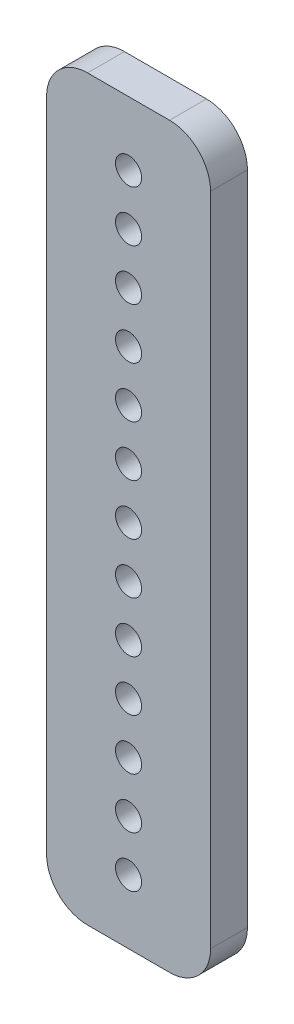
ISO-10303-21;
HEADER;
FILE_DESCRIPTION(('STEP AP214'),'2;1');
FILE_NAME('part.step','',(''),(''),'','','');
FILE_SCHEMA(('AUTOMOTIVE_DESIGN { 1 0 10303 214 1 1 1 1 }'));
ENDSEC;
DATA;
#1=APPLICATION_CONTEXT('core data for automotive mechanical design processes');
#2=APPLICATION_PROTOCOL_DEFINITION('international standard','automotive_design',2000,#1);
#3=PRODUCT_CONTEXT('',#1,'mechanical');
#4=PRODUCT('Part','Part','',(#3));
#5=PRODUCT_RELATED_PRODUCT_CATEGORY('part','',(#4));
#6=PRODUCT_DEFINITION_FORMATION('','',#4);
#7=PRODUCT_DEFINITION_CONTEXT('part definition',#1,'design');
#8=PRODUCT_DEFINITION('design','',#6,#7);
#9=PRODUCT_DEFINITION_SHAPE('','',#8);
#10=(LENGTH_UNIT() NAMED_UNIT(*) SI_UNIT(.MILLI.,.METRE.));
#11=(NAMED_UNIT(*) PLANE_ANGLE_UNIT() SI_UNIT($,.RADIAN.));
#12=(NAMED_UNIT(*) SI_UNIT($,.STERADIAN.) SOLID_ANGLE_UNIT());
#13=UNCERTAINTY_MEASURE_WITH_UNIT(LENGTH_MEASURE(1.E-05),#10,'distance_accuracy_value','');
#14=(GEOMETRIC_REPRESENTATION_CONTEXT(3) GLOBAL_UNCERTAINTY_ASSIGNED_CONTEXT((#13)) GLOBAL_UNIT_ASSIGNED_CONTEXT((#10,
#11,#12)) REPRESENTATION_CONTEXT('',''));
#15=CARTESIAN_POINT('',(0.,0.,0.));
#16=DIRECTION('',(0.,0.,1.));
#17=DIRECTION('',(1.,0.,0.));
#18=AXIS2_PLACEMENT_3D('',#15,#16,#17);
#19=CARTESIAN_POINT('',(12.7,57.15,5.715));
#20=DIRECTION('',(-1.,0.,0.));
#21=DIRECTION('',(0.,-1.,0.));
#22=AXIS2_PLACEMENT_3D('',#19,#20,#21);
#23=PLANE('',#22);
#24=DIRECTION('',(0.,1.,0.));
#25=VECTOR('',#24,1.);
#26=CARTESIAN_POINT('',(12.7,57.15,5.715));
#27=LINE('',#26,#25);
#28=CARTESIAN_POINT('',(12.7,-50.8,5.715));
#29=VERTEX_POINT('',#28);
#30=CARTESIAN_POINT('',(12.7,50.8,5.715));
#31=VERTEX_POINT('',#30);
#32=EDGE_CURVE('E119',#29,#31,#27,.T.);
#33=ORIENTED_EDGE('',*,*,#32,.F.);
#34=DIRECTION('',(0.,0.,-1.));
#35=VECTOR('',#34,1.);
#36=CARTESIAN_POINT('',(12.7,-50.8,5.715));
#37=LINE('',#36,#35);
#38=CARTESIAN_POINT('',(12.7,-50.8,0.));
#39=VERTEX_POINT('',#38);
#40=EDGE_CURVE('E104',#29,#39,#37,.T.);
#41=ORIENTED_EDGE('',*,*,#40,.T.);
#42=DIRECTION('',(0.,1.,0.));
#43=VECTOR('',#42,1.);
#44=CARTESIAN_POINT('',(12.7,57.15,0.));
#45=LINE('',#44,#43);
#46=CARTESIAN_POINT('',(12.7,50.8,0.));
#47=VERTEX_POINT('',#46);
#48=EDGE_CURVE('E116',#39,#47,#45,.T.);
#49=ORIENTED_EDGE('',*,*,#48,.T.);
#50=DIRECTION('',(0.,0.,-1.));
#51=VECTOR('',#50,1.);
#52=CARTESIAN_POINT('',(12.7,50.8,5.715));
#53=LINE('',#52,#51);
#54=EDGE_CURVE('E121',#47,#31,#53,.F.);
#55=ORIENTED_EDGE('',*,*,#54,.T.);
#56=EDGE_LOOP('',(#33,#41,#49,#55));
#57=FACE_BOUND('',#56,.T.);
#58=ADVANCED_FACE('F33',(#57),#23,.F.);
#59=CARTESIAN_POINT('',(-12.7,57.15,5.715));
#60=DIRECTION('',(0.,-1.,0.));
#61=DIRECTION('',(0.,0.,-1.));
#62=AXIS2_PLACEMENT_3D('',#59,#60,#61);
#63=PLANE('',#62);
#64=DIRECTION('',(-1.,0.,0.));
#65=VECTOR('',#64,1.);
#66=CARTESIAN_POINT('',(-12.7,57.15,5.715));
#67=LINE('',#66,#65);
#68=CARTESIAN_POINT('',(6.34999999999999,57.15,5.715));
#69=VERTEX_POINT('',#68);
#70=CARTESIAN_POINT('',(-6.35,57.15,5.715));
#71=VERTEX_POINT('',#70);
#72=EDGE_CURVE('E163',#69,#71,#67,.T.);
#73=ORIENTED_EDGE('',*,*,#72,.F.);
#74=DIRECTION('',(0.,0.,-1.));
#75=VECTOR('',#74,1.);
#76=CARTESIAN_POINT('',(6.34999999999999,57.15,5.715));
#77=LINE('',#76,#75);
#78=CARTESIAN_POINT('',(6.34999999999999,57.15,0.));
#79=VERTEX_POINT('',#78);
#80=EDGE_CURVE('E11',#69,#79,#77,.T.);
#81=ORIENTED_EDGE('',*,*,#80,.T.);
#82=DIRECTION('',(-1.,0.,0.));
#83=VECTOR('',#82,1.);
#84=CARTESIAN_POINT('',(-12.7,57.15,0.));
#85=LINE('',#84,#83);
#86=CARTESIAN_POINT('',(-6.35,57.15,0.));
#87=VERTEX_POINT('',#86);
#88=EDGE_CURVE('E126',#79,#87,#85,.T.);
#89=ORIENTED_EDGE('',*,*,#88,.T.);
#90=DIRECTION('',(0.,0.,-1.));
#91=VECTOR('',#90,1.);
#92=CARTESIAN_POINT('',(-6.35,57.15,5.715));
#93=LINE('',#92,#91);
#94=EDGE_CURVE('E41',#87,#71,#93,.F.);
#95=ORIENTED_EDGE('',*,*,#94,.T.);
#96=EDGE_LOOP('',(#73,#81,#89,#95));
#97=FACE_BOUND('',#96,.T.);
#98=ADVANCED_FACE('F162',(#97),#63,.F.);
#99=CARTESIAN_POINT('',(-12.7,57.15,5.715));
#100=DIRECTION('',(1.,0.,0.));
#101=DIRECTION('',(0.,1.,0.));
#102=AXIS2_PLACEMENT_3D('',#99,#100,#101);
#103=PLANE('',#102);
#104=DIRECTION('',(0.,-1.,0.));
#105=VECTOR('',#104,1.);
#106=CARTESIAN_POINT('',(-12.7,57.15,0.));
#107=LINE('',#106,#105);
#108=CARTESIAN_POINT('',(-12.7,50.8,0.));
#109=VERTEX_POINT('',#108);
#110=CARTESIAN_POINT('',(-12.7,-50.8,0.));
#111=VERTEX_POINT('',#110);
#112=EDGE_CURVE('E130',#109,#111,#107,.T.);
#113=ORIENTED_EDGE('',*,*,#112,.T.);
#114=DIRECTION('',(0.,0.,-1.));
#115=VECTOR('',#114,1.);
#116=CARTESIAN_POINT('',(-12.7,-50.8,5.715));
#117=LINE('',#116,#115);
#118=CARTESIAN_POINT('',(-12.7,-50.8,5.715));
#119=VERTEX_POINT('',#118);
#120=EDGE_CURVE('E48',#111,#119,#117,.F.);
#121=ORIENTED_EDGE('',*,*,#120,.T.);
#122=DIRECTION('',(0.,-1.,0.));
#123=VECTOR('',#122,1.);
#124=CARTESIAN_POINT('',(-12.7,57.15,5.715));
#125=LINE('',#124,#123);
#126=CARTESIAN_POINT('',(-12.7,50.8,5.715));
#127=VERTEX_POINT('',#126);
#128=EDGE_CURVE('E169',#127,#119,#125,.T.);
#129=ORIENTED_EDGE('',*,*,#128,.F.);
#130=DIRECTION('',(0.,0.,-1.));
#131=VECTOR('',#130,1.);
#132=CARTESIAN_POINT('',(-12.7,50.8,5.715));
#133=LINE('',#132,#131);
#134=EDGE_CURVE('E156',#127,#109,#133,.T.);
#135=ORIENTED_EDGE('',*,*,#134,.T.);
#136=EDGE_LOOP('',(#113,#121,#129,#135));
#137=FACE_BOUND('',#136,.T.);
#138=ADVANCED_FACE('F173',(#137),#103,.F.);
#139=CARTESIAN_POINT('',(-12.7,-57.15,5.715));
#140=DIRECTION('',(0.,1.,0.));
#141=DIRECTION('',(0.,0.,1.));
#142=AXIS2_PLACEMENT_3D('',#139,#140,#141);
#143=PLANE('',#142);
#144=DIRECTION('',(1.,0.,0.));
#145=VECTOR('',#144,1.);
#146=CARTESIAN_POINT('',(-12.7,-57.15,0.));
#147=LINE('',#146,#145);
#148=CARTESIAN_POINT('',(-6.34999999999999,-57.15,0.));
#149=VERTEX_POINT('',#148);
#150=CARTESIAN_POINT('',(6.35000000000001,-57.15,0.));
#151=VERTEX_POINT('',#150);
#152=EDGE_CURVE('E140',#149,#151,#147,.T.);
#153=ORIENTED_EDGE('',*,*,#152,.T.);
#154=DIRECTION('',(0.,0.,-1.));
#155=VECTOR('',#154,1.);
#156=CARTESIAN_POINT('',(6.35000000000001,-57.15,5.715));
#157=LINE('',#156,#155);
#158=CARTESIAN_POINT('',(6.35000000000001,-57.15,5.715));
#159=VERTEX_POINT('',#158);
#160=EDGE_CURVE('E105',#151,#159,#157,.F.);
#161=ORIENTED_EDGE('',*,*,#160,.T.);
#162=DIRECTION('',(1.,0.,0.));
#163=VECTOR('',#162,1.);
#164=CARTESIAN_POINT('',(-12.7,-57.15,5.715));
#165=LINE('',#164,#163);
#166=CARTESIAN_POINT('',(-6.34999999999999,-57.15,5.715));
#167=VERTEX_POINT('',#166);
#168=EDGE_CURVE('E136',#167,#159,#165,.T.);
#169=ORIENTED_EDGE('',*,*,#168,.F.);
#170=DIRECTION('',(0.,0.,-1.));
#171=VECTOR('',#170,1.);
#172=CARTESIAN_POINT('',(-6.34999999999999,-57.15,5.715));
#173=LINE('',#172,#171);
#174=EDGE_CURVE('E110',#167,#149,#173,.T.);
#175=ORIENTED_EDGE('',*,*,#174,.T.);
#176=EDGE_LOOP('',(#153,#161,#169,#175));
#177=FACE_BOUND('',#176,.T.);
#178=ADVANCED_FACE('F180',(#177),#143,.F.);
#179=CARTESIAN_POINT('',(0.,0.,5.715));
#180=DIRECTION('',(0.,0.,1.));
#181=DIRECTION('',(1.,0.,0.));
#182=AXIS2_PLACEMENT_3D('',#179,#180,#181);
#183=PLANE('',#182);
#184=CARTESIAN_POINT('',(1.16623225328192E-12,-47.244,5.715));
#185=DIRECTION('',(0.,0.,1.));
#186=DIRECTION('',(1.,0.,0.));
#187=AXIS2_PLACEMENT_3D('',#184,#185,#186);
#188=CIRCLE('',#187,2.0193);
#189=CARTESIAN_POINT('',(2.01930000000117,-47.244,5.715));
#190=VERTEX_POINT('',#189);
#191=EDGE_CURVE('E186',#190,#190,#188,.T.);
#192=ORIENTED_EDGE('',*,*,#191,.F.);
#193=EDGE_LOOP('',(#192));
#194=FACE_BOUND('',#193,.T.);
#195=CARTESIAN_POINT('',(9.71860211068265E-13,-39.37,5.715));
#196=DIRECTION('',(0.,0.,1.));
#197=DIRECTION('',(1.,0.,0.));
#198=AXIS2_PLACEMENT_3D('',#195,#196,#197);
#199=CIRCLE('',#198,2.0193);
#200=CARTESIAN_POINT('',(2.01930000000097,-39.37,5.715));
#201=VERTEX_POINT('',#200);
#202=EDGE_CURVE('E192',#201,#201,#199,.T.);
#203=ORIENTED_EDGE('',*,*,#202,.F.);
#204=EDGE_LOOP('',(#203));
#205=FACE_BOUND('',#204,.T.);
#206=CARTESIAN_POINT('',(7.77488168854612E-13,-31.496,5.715));
#207=DIRECTION('',(0.,0.,1.));
#208=DIRECTION('',(1.,0.,0.));
#209=AXIS2_PLACEMENT_3D('',#206,#207,#208);
#210=CIRCLE('',#209,2.0193);
#211=CARTESIAN_POINT('',(2.01930000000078,-31.496,5.715));
#212=VERTEX_POINT('',#211);
#213=EDGE_CURVE('E198',#212,#212,#210,.T.);
#214=ORIENTED_EDGE('',*,*,#213,.F.);
#215=EDGE_LOOP('',(#214));
#216=FACE_BOUND('',#215,.T.);
#217=CARTESIAN_POINT('',(5.83116126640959E-13,-23.622,5.715));
#218=DIRECTION('',(0.,0.,1.));
#219=DIRECTION('',(1.,0.,0.));
#220=AXIS2_PLACEMENT_3D('',#217,#218,#219);
#221=CIRCLE('',#220,2.0193);
#222=CARTESIAN_POINT('',(2.01930000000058,-23.622,5.715));
#223=VERTEX_POINT('',#222);
#224=EDGE_CURVE('E204',#223,#223,#221,.T.);
#225=ORIENTED_EDGE('',*,*,#224,.F.);
#226=EDGE_LOOP('',(#225));
#227=FACE_BOUND('',#226,.T.);
#228=CARTESIAN_POINT('',(0.,7.874,5.715));
#229=DIRECTION('',(0.,0.,1.));
#230=DIRECTION('',(1.,0.,0.));
#231=AXIS2_PLACEMENT_3D('',#228,#229,#230);
#232=CIRCLE('',#231,2.0193);
#233=CARTESIAN_POINT('',(2.01929999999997,7.874,5.715));
#234=VERTEX_POINT('',#233);
#235=EDGE_CURVE('E230',#234,#234,#232,.T.);
#236=ORIENTED_EDGE('',*,*,#235,.F.);
#237=EDGE_LOOP('',(#236));
#238=FACE_BOUND('',#237,.T.);
#239=CARTESIAN_POINT('',(0.,15.748,5.715));
#240=DIRECTION('',(0.,0.,1.));
#241=DIRECTION('',(1.,0.,0.));
#242=AXIS2_PLACEMENT_3D('',#239,#240,#241);
#243=CIRCLE('',#242,2.0193);
#244=CARTESIAN_POINT('',(2.01929999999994,15.748,5.715));
#245=VERTEX_POINT('',#244);
#246=EDGE_CURVE('E224',#245,#245,#243,.T.);
#247=ORIENTED_EDGE('',*,*,#246,.F.);
#248=EDGE_LOOP('',(#247));
#249=FACE_BOUND('',#248,.T.);
#250=CARTESIAN_POINT('',(0.,23.622,5.715));
#251=DIRECTION('',(0.,0.,1.));
#252=DIRECTION('',(1.,0.,0.));
#253=AXIS2_PLACEMENT_3D('',#250,#251,#252);
#254=CIRCLE('',#253,2.0193);
#255=CARTESIAN_POINT('',(2.01929999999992,23.622,5.715));
#256=VERTEX_POINT('',#255);
#257=EDGE_CURVE('E218',#256,#256,#254,.T.);
#258=ORIENTED_EDGE('',*,*,#257,.F.);
#259=EDGE_LOOP('',(#258));
#260=FACE_BOUND('',#259,.T.);
#261=CARTESIAN_POINT('',(-1.09967696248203E-13,31.496,5.715));
#262=DIRECTION('',(0.,0.,1.));
#263=DIRECTION('',(1.,0.,0.));
#264=AXIS2_PLACEMENT_3D('',#261,#262,#263);
#265=CIRCLE('',#264,2.0193);
#266=CARTESIAN_POINT('',(2.01929999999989,31.496,5.715));
#267=VERTEX_POINT('',#266);
#268=EDGE_CURVE('E211',#267,#267,#265,.T.);
#269=ORIENTED_EDGE('',*,*,#268,.F.);
#270=EDGE_LOOP('',(#269));
#271=FACE_BOUND('',#270,.T.);
#272=CARTESIAN_POINT('',(-1.37459620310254E-13,39.37,5.715));
#273=DIRECTION('',(0.,0.,1.));
#274=DIRECTION('',(1.,0.,0.));
#275=AXIS2_PLACEMENT_3D('',#272,#273,#274);
#276=CIRCLE('',#275,2.0193);
#277=CARTESIAN_POINT('',(2.01929999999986,39.37,5.715));
#278=VERTEX_POINT('',#277);
#279=EDGE_CURVE('E252',#278,#278,#276,.T.);
#280=ORIENTED_EDGE('',*,*,#279,.F.);
#281=EDGE_LOOP('',(#280));
#282=FACE_BOUND('',#281,.T.);
#283=CARTESIAN_POINT('',(-1.64951544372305E-13,47.244,5.715));
#284=DIRECTION('',(0.,0.,1.));
#285=DIRECTION('',(1.,0.,0.));
#286=AXIS2_PLACEMENT_3D('',#283,#284,#285);
#287=CIRCLE('',#286,2.0193);
#288=CARTESIAN_POINT('',(2.01929999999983,47.244,5.715));
#289=VERTEX_POINT('',#288);
#290=EDGE_CURVE('E246',#289,#289,#287,.T.);
#291=ORIENTED_EDGE('',*,*,#290,.F.);
#292=EDGE_LOOP('',(#291));
#293=FACE_BOUND('',#292,.T.);
#294=CARTESIAN_POINT('',(1.94372042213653E-13,-7.874,5.715));
#295=DIRECTION('',(0.,0.,1.));
#296=DIRECTION('',(1.,0.,0.));
#297=AXIS2_PLACEMENT_3D('',#294,#295,#296);
#298=CIRCLE('',#297,2.0193);
#299=CARTESIAN_POINT('',(2.01930000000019,-7.874,5.715));
#300=VERTEX_POINT('',#299);
#301=EDGE_CURVE('E240',#300,#300,#298,.T.);
#302=ORIENTED_EDGE('',*,*,#301,.F.);
#303=EDGE_LOOP('',(#302));
#304=FACE_BOUND('',#303,.T.);
#305=CARTESIAN_POINT('',(3.88744084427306E-13,-15.748,5.715));
#306=DIRECTION('',(0.,0.,1.));
#307=DIRECTION('',(1.,0.,0.));
#308=AXIS2_PLACEMENT_3D('',#305,#306,#307);
#309=CIRCLE('',#308,2.0193);
#310=CARTESIAN_POINT('',(2.01930000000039,-15.748,5.715));
#311=VERTEX_POINT('',#310);
#312=EDGE_CURVE('E210',#311,#311,#309,.T.);
#313=ORIENTED_EDGE('',*,*,#312,.F.);
#314=EDGE_LOOP('',(#313));
#315=FACE_BOUND('',#314,.T.);
#316=CARTESIAN_POINT('',(0.,0.,5.715));
#317=DIRECTION('',(0.,0.,1.));
#318=DIRECTION('',(1.,0.,0.));
#319=AXIS2_PLACEMENT_3D('',#316,#317,#318);
#320=CIRCLE('',#319,2.0193);
#321=CARTESIAN_POINT('',(2.0193,0.,5.715));
#322=VERTEX_POINT('',#321);
#323=EDGE_CURVE('E133',#322,#322,#320,.T.);
#324=ORIENTED_EDGE('',*,*,#323,.F.);
#325=EDGE_LOOP('',(#324));
#326=FACE_BOUND('',#325,.T.);
#327=ORIENTED_EDGE('',*,*,#168,.T.);
#328=CARTESIAN_POINT('',(6.35000000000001,-50.8,5.715));
#329=DIRECTION('',(0.,0.,1.));
#330=DIRECTION('',(1.,0.,0.));
#331=AXIS2_PLACEMENT_3D('',#328,#329,#330);
#332=CIRCLE('',#331,6.35);
#333=EDGE_CURVE('E154',#159,#29,#332,.T.);
#334=ORIENTED_EDGE('',*,*,#333,.T.);
#335=ORIENTED_EDGE('',*,*,#32,.T.);
#336=CARTESIAN_POINT('',(6.34999999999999,50.8,5.715));
#337=DIRECTION('',(0.,0.,1.));
#338=DIRECTION('',(1.,0.,0.));
#339=AXIS2_PLACEMENT_3D('',#336,#337,#338);
#340=CIRCLE('',#339,6.35);
#341=EDGE_CURVE('E150',#31,#69,#340,.T.);
#342=ORIENTED_EDGE('',*,*,#341,.T.);
#343=ORIENTED_EDGE('',*,*,#72,.T.);
#344=CARTESIAN_POINT('',(-6.35,50.8,5.715));
#345=DIRECTION('',(0.,0.,1.));
#346=DIRECTION('',(1.,0.,0.));
#347=AXIS2_PLACEMENT_3D('',#344,#345,#346);
#348=CIRCLE('',#347,6.35);
#349=EDGE_CURVE('E55',#71,#127,#348,.T.);
#350=ORIENTED_EDGE('',*,*,#349,.T.);
#351=ORIENTED_EDGE('',*,*,#128,.T.);
#352=CARTESIAN_POINT('',(-6.34999999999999,-50.8,5.715));
#353=DIRECTION('',(0.,0.,1.));
#354=DIRECTION('',(1.,0.,0.));
#355=AXIS2_PLACEMENT_3D('',#352,#353,#354);
#356=CIRCLE('',#355,6.35);
#357=EDGE_CURVE('E152',#119,#167,#356,.T.);
#358=ORIENTED_EDGE('',*,*,#357,.T.);
#359=EDGE_LOOP('',(#327,#334,#335,#342,#343,#350,#351,#358));
#360=FACE_BOUND('',#359,.T.);
#361=ADVANCED_FACE('F167',(#194,#205,#216,#227,#238,#249,#260,#271,#282,#293,#304,#315,#326,
#360),#183,.T.);
#362=CARTESIAN_POINT('',(0.,0.,0.));
#363=DIRECTION('',(0.,0.,1.));
#364=DIRECTION('',(1.,0.,0.));
#365=AXIS2_PLACEMENT_3D('',#362,#363,#364);
#366=PLANE('',#365);
#367=CARTESIAN_POINT('',(1.16623225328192E-12,-47.244,0.));
#368=DIRECTION('',(0.,0.,1.));
#369=DIRECTION('',(1.,0.,0.));
#370=AXIS2_PLACEMENT_3D('',#367,#368,#369);
#371=CIRCLE('',#370,2.0193);
#372=CARTESIAN_POINT('',(2.01930000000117,-47.244,0.));
#373=VERTEX_POINT('',#372);
#374=EDGE_CURVE('E189',#373,#373,#371,.T.);
#375=ORIENTED_EDGE('',*,*,#374,.T.);
#376=EDGE_LOOP('',(#375));
#377=FACE_BOUND('',#376,.T.);
#378=CARTESIAN_POINT('',(9.71860211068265E-13,-39.37,0.));
#379=DIRECTION('',(0.,0.,1.));
#380=DIRECTION('',(1.,0.,0.));
#381=AXIS2_PLACEMENT_3D('',#378,#379,#380);
#382=CIRCLE('',#381,2.0193);
#383=CARTESIAN_POINT('',(2.01930000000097,-39.37,0.));
#384=VERTEX_POINT('',#383);
#385=EDGE_CURVE('E195',#384,#384,#382,.T.);
#386=ORIENTED_EDGE('',*,*,#385,.T.);
#387=EDGE_LOOP('',(#386));
#388=FACE_BOUND('',#387,.T.);
#389=CARTESIAN_POINT('',(7.77488168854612E-13,-31.496,0.));
#390=DIRECTION('',(0.,0.,1.));
#391=DIRECTION('',(1.,0.,0.));
#392=AXIS2_PLACEMENT_3D('',#389,#390,#391);
#393=CIRCLE('',#392,2.0193);
#394=CARTESIAN_POINT('',(2.01930000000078,-31.496,0.));
#395=VERTEX_POINT('',#394);
#396=EDGE_CURVE('E201',#395,#395,#393,.T.);
#397=ORIENTED_EDGE('',*,*,#396,.T.);
#398=EDGE_LOOP('',(#397));
#399=FACE_BOUND('',#398,.T.);
#400=CARTESIAN_POINT('',(5.83116126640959E-13,-23.622,0.));
#401=DIRECTION('',(0.,0.,1.));
#402=DIRECTION('',(1.,0.,0.));
#403=AXIS2_PLACEMENT_3D('',#400,#401,#402);
#404=CIRCLE('',#403,2.0193);
#405=CARTESIAN_POINT('',(2.01930000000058,-23.622,0.));
#406=VERTEX_POINT('',#405);
#407=EDGE_CURVE('E207',#406,#406,#404,.T.);
#408=ORIENTED_EDGE('',*,*,#407,.T.);
#409=EDGE_LOOP('',(#408));
#410=FACE_BOUND('',#409,.T.);
#411=CARTESIAN_POINT('',(0.,7.874,0.));
#412=DIRECTION('',(0.,0.,1.));
#413=DIRECTION('',(1.,0.,0.));
#414=AXIS2_PLACEMENT_3D('',#411,#412,#413);
#415=CIRCLE('',#414,2.0193);
#416=CARTESIAN_POINT('',(2.01929999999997,7.874,0.));
#417=VERTEX_POINT('',#416);
#418=EDGE_CURVE('E184',#417,#417,#415,.T.);
#419=ORIENTED_EDGE('',*,*,#418,.T.);
#420=EDGE_LOOP('',(#419));
#421=FACE_BOUND('',#420,.T.);
#422=CARTESIAN_POINT('',(0.,15.748,0.));
#423=DIRECTION('',(0.,0.,1.));
#424=DIRECTION('',(1.,0.,0.));
#425=AXIS2_PLACEMENT_3D('',#422,#423,#424);
#426=CIRCLE('',#425,2.0193);
#427=CARTESIAN_POINT('',(2.01929999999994,15.748,0.));
#428=VERTEX_POINT('',#427);
#429=EDGE_CURVE('E227',#428,#428,#426,.T.);
#430=ORIENTED_EDGE('',*,*,#429,.T.);
#431=EDGE_LOOP('',(#430));
#432=FACE_BOUND('',#431,.T.);
#433=CARTESIAN_POINT('',(0.,23.622,0.));
#434=DIRECTION('',(0.,0.,1.));
#435=DIRECTION('',(1.,0.,0.));
#436=AXIS2_PLACEMENT_3D('',#433,#434,#435);
#437=CIRCLE('',#436,2.0193);
#438=CARTESIAN_POINT('',(2.01929999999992,23.622,0.));
#439=VERTEX_POINT('',#438);
#440=EDGE_CURVE('E221',#439,#439,#437,.T.);
#441=ORIENTED_EDGE('',*,*,#440,.T.);
#442=EDGE_LOOP('',(#441));
#443=FACE_BOUND('',#442,.T.);
#444=CARTESIAN_POINT('',(-1.09967696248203E-13,31.496,0.));
#445=DIRECTION('',(0.,0.,1.));
#446=DIRECTION('',(1.,0.,0.));
#447=AXIS2_PLACEMENT_3D('',#444,#445,#446);
#448=CIRCLE('',#447,2.0193);
#449=CARTESIAN_POINT('',(2.01929999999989,31.496,0.));
#450=VERTEX_POINT('',#449);
#451=EDGE_CURVE('E214',#450,#450,#448,.T.);
#452=ORIENTED_EDGE('',*,*,#451,.T.);
#453=EDGE_LOOP('',(#452));
#454=FACE_BOUND('',#453,.T.);
#455=CARTESIAN_POINT('',(-1.37459620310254E-13,39.37,0.));
#456=DIRECTION('',(0.,0.,1.));
#457=DIRECTION('',(1.,0.,0.));
#458=AXIS2_PLACEMENT_3D('',#455,#456,#457);
#459=CIRCLE('',#458,2.0193);
#460=CARTESIAN_POINT('',(2.01929999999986,39.37,0.));
#461=VERTEX_POINT('',#460);
#462=EDGE_CURVE('E215',#461,#461,#459,.T.);
#463=ORIENTED_EDGE('',*,*,#462,.T.);
#464=EDGE_LOOP('',(#463));
#465=FACE_BOUND('',#464,.T.);
#466=CARTESIAN_POINT('',(-1.64951544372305E-13,47.244,0.));
#467=DIRECTION('',(0.,0.,1.));
#468=DIRECTION('',(1.,0.,0.));
#469=AXIS2_PLACEMENT_3D('',#466,#467,#468);
#470=CIRCLE('',#469,2.0193);
#471=CARTESIAN_POINT('',(2.01929999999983,47.244,0.));
#472=VERTEX_POINT('',#471);
#473=EDGE_CURVE('E249',#472,#472,#470,.T.);
#474=ORIENTED_EDGE('',*,*,#473,.T.);
#475=EDGE_LOOP('',(#474));
#476=FACE_BOUND('',#475,.T.);
#477=CARTESIAN_POINT('',(1.94372042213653E-13,-7.874,0.));
#478=DIRECTION('',(0.,0.,1.));
#479=DIRECTION('',(1.,0.,0.));
#480=AXIS2_PLACEMENT_3D('',#477,#478,#479);
#481=CIRCLE('',#480,2.0193);
#482=CARTESIAN_POINT('',(2.01930000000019,-7.874,0.));
#483=VERTEX_POINT('',#482);
#484=EDGE_CURVE('E243',#483,#483,#481,.T.);
#485=ORIENTED_EDGE('',*,*,#484,.T.);
#486=EDGE_LOOP('',(#485));
#487=FACE_BOUND('',#486,.T.);
#488=CARTESIAN_POINT('',(3.88744084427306E-13,-15.748,0.));
#489=DIRECTION('',(0.,0.,1.));
#490=DIRECTION('',(1.,0.,0.));
#491=AXIS2_PLACEMENT_3D('',#488,#489,#490);
#492=CIRCLE('',#491,2.0193);
#493=CARTESIAN_POINT('',(2.01930000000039,-15.748,0.));
#494=VERTEX_POINT('',#493);
#495=EDGE_CURVE('E237',#494,#494,#492,.T.);
#496=ORIENTED_EDGE('',*,*,#495,.T.);
#497=EDGE_LOOP('',(#496));
#498=FACE_BOUND('',#497,.T.);
#499=CARTESIAN_POINT('',(0.,0.,0.));
#500=DIRECTION('',(0.,0.,1.));
#501=DIRECTION('',(1.,0.,0.));
#502=AXIS2_PLACEMENT_3D('',#499,#500,#501);
#503=CIRCLE('',#502,2.0193);
#504=CARTESIAN_POINT('',(2.0193,0.,0.));
#505=VERTEX_POINT('',#504);
#506=EDGE_CURVE('E127',#505,#505,#503,.T.);
#507=ORIENTED_EDGE('',*,*,#506,.T.);
#508=EDGE_LOOP('',(#507));
#509=FACE_BOUND('',#508,.T.);
#510=ORIENTED_EDGE('',*,*,#48,.F.);
#511=CARTESIAN_POINT('',(6.35000000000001,-50.8,0.));
#512=DIRECTION('',(0.,0.,1.));
#513=DIRECTION('',(1.,0.,0.));
#514=AXIS2_PLACEMENT_3D('',#511,#512,#513);
#515=CIRCLE('',#514,6.35);
#516=EDGE_CURVE('E100',#39,#151,#515,.F.);
#517=ORIENTED_EDGE('',*,*,#516,.T.);
#518=ORIENTED_EDGE('',*,*,#152,.F.);
#519=CARTESIAN_POINT('',(-6.34999999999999,-50.8,0.));
#520=DIRECTION('',(0.,0.,1.));
#521=DIRECTION('',(1.,0.,0.));
#522=AXIS2_PLACEMENT_3D('',#519,#520,#521);
#523=CIRCLE('',#522,6.35);
#524=EDGE_CURVE('E111',#149,#111,#523,.F.);
#525=ORIENTED_EDGE('',*,*,#524,.T.);
#526=ORIENTED_EDGE('',*,*,#112,.F.);
#527=CARTESIAN_POINT('',(-6.35,50.8,0.));
#528=DIRECTION('',(0.,0.,1.));
#529=DIRECTION('',(1.,0.,0.));
#530=AXIS2_PLACEMENT_3D('',#527,#528,#529);
#531=CIRCLE('',#530,6.35);
#532=EDGE_CURVE('E120',#109,#87,#531,.F.);
#533=ORIENTED_EDGE('',*,*,#532,.T.);
#534=ORIENTED_EDGE('',*,*,#88,.F.);
#535=CARTESIAN_POINT('',(6.34999999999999,50.8,0.));
#536=DIRECTION('',(0.,0.,1.));
#537=DIRECTION('',(1.,0.,0.));
#538=AXIS2_PLACEMENT_3D('',#535,#536,#537);
#539=CIRCLE('',#538,6.35);
#540=EDGE_CURVE('E125',#79,#47,#539,.F.);
#541=ORIENTED_EDGE('',*,*,#540,.T.);
#542=EDGE_LOOP('',(#510,#517,#518,#525,#526,#533,#534,#541));
#543=FACE_BOUND('',#542,.T.);
#544=ADVANCED_FACE('F123',(#377,#388,#399,#410,#421,#432,#443,#454,#465,#476,#487,#498,#509,
#543),#366,.F.);
#545=CARTESIAN_POINT('',(0.,0.,0.));
#546=DIRECTION('',(0.,0.,1.));
#547=DIRECTION('',(1.,0.,0.));
#548=AXIS2_PLACEMENT_3D('',#545,#546,#547);
#549=CYLINDRICAL_SURFACE('',#548,2.0193);
#550=ORIENTED_EDGE('',*,*,#506,.F.);
#551=EDGE_LOOP('',(#550));
#552=FACE_BOUND('',#551,.T.);
#553=ORIENTED_EDGE('',*,*,#323,.T.);
#554=EDGE_LOOP('',(#553));
#555=FACE_BOUND('',#554,.T.);
#556=ADVANCED_FACE('F280',(#552,#555),#549,.F.);
#557=CARTESIAN_POINT('',(3.88744084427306E-13,-15.748,0.));
#558=DIRECTION('',(0.,0.,1.));
#559=DIRECTION('',(1.,0.,0.));
#560=AXIS2_PLACEMENT_3D('',#557,#558,#559);
#561=CYLINDRICAL_SURFACE('',#560,2.0193);
#562=ORIENTED_EDGE('',*,*,#495,.F.);
#563=EDGE_LOOP('',(#562));
#564=FACE_BOUND('',#563,.T.);
#565=ORIENTED_EDGE('',*,*,#312,.T.);
#566=EDGE_LOOP('',(#565));
#567=FACE_BOUND('',#566,.T.);
#568=ADVANCED_FACE('F282',(#564,#567),#561,.F.);
#569=CARTESIAN_POINT('',(1.94372042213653E-13,-7.874,0.));
#570=DIRECTION('',(0.,0.,1.));
#571=DIRECTION('',(1.,0.,0.));
#572=AXIS2_PLACEMENT_3D('',#569,#570,#571);
#573=CYLINDRICAL_SURFACE('',#572,2.0193);
#574=ORIENTED_EDGE('',*,*,#484,.F.);
#575=EDGE_LOOP('',(#574));
#576=FACE_BOUND('',#575,.T.);
#577=ORIENTED_EDGE('',*,*,#301,.T.);
#578=EDGE_LOOP('',(#577));
#579=FACE_BOUND('',#578,.T.);
#580=ADVANCED_FACE('F289',(#576,#579),#573,.F.);
#581=CARTESIAN_POINT('',(-1.64951544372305E-13,47.244,0.));
#582=DIRECTION('',(0.,0.,1.));
#583=DIRECTION('',(1.,0.,0.));
#584=AXIS2_PLACEMENT_3D('',#581,#582,#583);
#585=CYLINDRICAL_SURFACE('',#584,2.0193);
#586=ORIENTED_EDGE('',*,*,#473,.F.);
#587=EDGE_LOOP('',(#586));
#588=FACE_BOUND('',#587,.T.);
#589=ORIENTED_EDGE('',*,*,#290,.T.);
#590=EDGE_LOOP('',(#589));
#591=FACE_BOUND('',#590,.T.);
#592=ADVANCED_FACE('F264',(#588,#591),#585,.F.);
#593=CARTESIAN_POINT('',(-1.37459620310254E-13,39.37,0.));
#594=DIRECTION('',(0.,0.,1.));
#595=DIRECTION('',(1.,0.,0.));
#596=AXIS2_PLACEMENT_3D('',#593,#594,#595);
#597=CYLINDRICAL_SURFACE('',#596,2.0193);
#598=ORIENTED_EDGE('',*,*,#462,.F.);
#599=EDGE_LOOP('',(#598));
#600=FACE_BOUND('',#599,.T.);
#601=ORIENTED_EDGE('',*,*,#279,.T.);
#602=EDGE_LOOP('',(#601));
#603=FACE_BOUND('',#602,.T.);
#604=ADVANCED_FACE('F260',(#600,#603),#597,.F.);
#605=CARTESIAN_POINT('',(-1.09967696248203E-13,31.496,0.));
#606=DIRECTION('',(0.,0.,1.));
#607=DIRECTION('',(1.,0.,0.));
#608=AXIS2_PLACEMENT_3D('',#605,#606,#607);
#609=CYLINDRICAL_SURFACE('',#608,2.0193);
#610=ORIENTED_EDGE('',*,*,#451,.F.);
#611=EDGE_LOOP('',(#610));
#612=FACE_BOUND('',#611,.T.);
#613=ORIENTED_EDGE('',*,*,#268,.T.);
#614=EDGE_LOOP('',(#613));
#615=FACE_BOUND('',#614,.T.);
#616=ADVANCED_FACE('F263',(#612,#615),#609,.F.);
#617=CARTESIAN_POINT('',(0.,23.622,0.));
#618=DIRECTION('',(0.,0.,1.));
#619=DIRECTION('',(1.,0.,0.));
#620=AXIS2_PLACEMENT_3D('',#617,#618,#619);
#621=CYLINDRICAL_SURFACE('',#620,2.0193);
#622=ORIENTED_EDGE('',*,*,#440,.F.);
#623=EDGE_LOOP('',(#622));
#624=FACE_BOUND('',#623,.T.);
#625=ORIENTED_EDGE('',*,*,#257,.T.);
#626=EDGE_LOOP('',(#625));
#627=FACE_BOUND('',#626,.T.);
#628=ADVANCED_FACE('F428',(#624,#627),#621,.F.);
#629=CARTESIAN_POINT('',(0.,15.748,0.));
#630=DIRECTION('',(0.,0.,1.));
#631=DIRECTION('',(1.,0.,0.));
#632=AXIS2_PLACEMENT_3D('',#629,#630,#631);
#633=CYLINDRICAL_SURFACE('',#632,2.0193);
#634=ORIENTED_EDGE('',*,*,#429,.F.);
#635=EDGE_LOOP('',(#634));
#636=FACE_BOUND('',#635,.T.);
#637=ORIENTED_EDGE('',*,*,#246,.T.);
#638=EDGE_LOOP('',(#637));
#639=FACE_BOUND('',#638,.T.);
#640=ADVANCED_FACE('F418',(#636,#639),#633,.F.);
#641=CARTESIAN_POINT('',(0.,7.874,0.));
#642=DIRECTION('',(0.,0.,1.));
#643=DIRECTION('',(1.,0.,0.));
#644=AXIS2_PLACEMENT_3D('',#641,#642,#643);
#645=CYLINDRICAL_SURFACE('',#644,2.0193);
#646=ORIENTED_EDGE('',*,*,#418,.F.);
#647=EDGE_LOOP('',(#646));
#648=FACE_BOUND('',#647,.T.);
#649=ORIENTED_EDGE('',*,*,#235,.T.);
#650=EDGE_LOOP('',(#649));
#651=FACE_BOUND('',#650,.T.);
#652=ADVANCED_FACE('F408',(#648,#651),#645,.F.);
#653=CARTESIAN_POINT('',(5.83116126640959E-13,-23.622,0.));
#654=DIRECTION('',(0.,0.,1.));
#655=DIRECTION('',(1.,0.,0.));
#656=AXIS2_PLACEMENT_3D('',#653,#654,#655);
#657=CYLINDRICAL_SURFACE('',#656,2.0193);
#658=ORIENTED_EDGE('',*,*,#407,.F.);
#659=EDGE_LOOP('',(#658));
#660=FACE_BOUND('',#659,.T.);
#661=ORIENTED_EDGE('',*,*,#224,.T.);
#662=EDGE_LOOP('',(#661));
#663=FACE_BOUND('',#662,.T.);
#664=ADVANCED_FACE('F398',(#660,#663),#657,.F.);
#665=CARTESIAN_POINT('',(7.77488168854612E-13,-31.496,0.));
#666=DIRECTION('',(0.,0.,1.));
#667=DIRECTION('',(1.,0.,0.));
#668=AXIS2_PLACEMENT_3D('',#665,#666,#667);
#669=CYLINDRICAL_SURFACE('',#668,2.0193);
#670=ORIENTED_EDGE('',*,*,#396,.F.);
#671=EDGE_LOOP('',(#670));
#672=FACE_BOUND('',#671,.T.);
#673=ORIENTED_EDGE('',*,*,#213,.T.);
#674=EDGE_LOOP('',(#673));
#675=FACE_BOUND('',#674,.T.);
#676=ADVANCED_FACE('F388',(#672,#675),#669,.F.);
#677=CARTESIAN_POINT('',(9.71860211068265E-13,-39.37,0.));
#678=DIRECTION('',(0.,0.,1.));
#679=DIRECTION('',(1.,0.,0.));
#680=AXIS2_PLACEMENT_3D('',#677,#678,#679);
#681=CYLINDRICAL_SURFACE('',#680,2.0193);
#682=ORIENTED_EDGE('',*,*,#385,.F.);
#683=EDGE_LOOP('',(#682));
#684=FACE_BOUND('',#683,.T.);
#685=ORIENTED_EDGE('',*,*,#202,.T.);
#686=EDGE_LOOP('',(#685));
#687=FACE_BOUND('',#686,.T.);
#688=ADVANCED_FACE('F379',(#684,#687),#681,.F.);
#689=CARTESIAN_POINT('',(1.16623225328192E-12,-47.244,0.));
#690=DIRECTION('',(0.,0.,1.));
#691=DIRECTION('',(1.,0.,0.));
#692=AXIS2_PLACEMENT_3D('',#689,#690,#691);
#693=CYLINDRICAL_SURFACE('',#692,2.0193);
#694=ORIENTED_EDGE('',*,*,#374,.F.);
#695=EDGE_LOOP('',(#694));
#696=FACE_BOUND('',#695,.T.);
#697=ORIENTED_EDGE('',*,*,#191,.T.);
#698=EDGE_LOOP('',(#697));
#699=FACE_BOUND('',#698,.T.);
#700=ADVANCED_FACE('F306',(#696,#699),#693,.F.);
#701=CARTESIAN_POINT('',(6.35000000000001,-50.8,5.715));
#702=DIRECTION('',(0.,0.,-1.));
#703=DIRECTION('',(-1.,0.,0.));
#704=AXIS2_PLACEMENT_3D('',#701,#702,#703);
#705=CYLINDRICAL_SURFACE('',#704,6.35);
#706=ORIENTED_EDGE('',*,*,#333,.F.);
#707=ORIENTED_EDGE('',*,*,#160,.F.);
#708=ORIENTED_EDGE('',*,*,#516,.F.);
#709=ORIENTED_EDGE('',*,*,#40,.F.);
#710=EDGE_LOOP('',(#706,#707,#708,#709));
#711=FACE_BOUND('',#710,.T.);
#712=ADVANCED_FACE('F103',(#711),#705,.T.);
#713=CARTESIAN_POINT('',(-6.34999999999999,-50.8,5.715));
#714=DIRECTION('',(0.,0.,-1.));
#715=DIRECTION('',(-1.,0.,0.));
#716=AXIS2_PLACEMENT_3D('',#713,#714,#715);
#717=CYLINDRICAL_SURFACE('',#716,6.35);
#718=ORIENTED_EDGE('',*,*,#357,.F.);
#719=ORIENTED_EDGE('',*,*,#120,.F.);
#720=ORIENTED_EDGE('',*,*,#524,.F.);
#721=ORIENTED_EDGE('',*,*,#174,.F.);
#722=EDGE_LOOP('',(#718,#719,#720,#721));
#723=FACE_BOUND('',#722,.T.);
#724=ADVANCED_FACE('F177',(#723),#717,.T.);
#725=CARTESIAN_POINT('',(6.34999999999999,50.8,5.715));
#726=DIRECTION('',(0.,0.,-1.));
#727=DIRECTION('',(-1.,0.,0.));
#728=AXIS2_PLACEMENT_3D('',#725,#726,#727);
#729=CYLINDRICAL_SURFACE('',#728,6.35);
#730=ORIENTED_EDGE('',*,*,#341,.F.);
#731=ORIENTED_EDGE('',*,*,#54,.F.);
#732=ORIENTED_EDGE('',*,*,#540,.F.);
#733=ORIENTED_EDGE('',*,*,#80,.F.);
#734=EDGE_LOOP('',(#730,#731,#732,#733));
#735=FACE_BOUND('',#734,.T.);
#736=ADVANCED_FACE('F308',(#735),#729,.T.);
#737=CARTESIAN_POINT('',(-6.35,50.8,5.715));
#738=DIRECTION('',(0.,0.,-1.));
#739=DIRECTION('',(-1.,0.,0.));
#740=AXIS2_PLACEMENT_3D('',#737,#738,#739);
#741=CYLINDRICAL_SURFACE('',#740,6.35);
#742=ORIENTED_EDGE('',*,*,#349,.F.);
#743=ORIENTED_EDGE('',*,*,#94,.F.);
#744=ORIENTED_EDGE('',*,*,#532,.F.);
#745=ORIENTED_EDGE('',*,*,#134,.F.);
#746=EDGE_LOOP('',(#742,#743,#744,#745));
#747=FACE_BOUND('',#746,.T.);
#748=ADVANCED_FACE('F35',(#747),#741,.T.);
#749=CLOSED_SHELL('',(#58,#98,#138,#178,#361,#544,#556,#568,#580,#592,#604,#616,#628,#640,#652,
#664,#676,#688,#700,#712,#724,#736,#748));
#750=MANIFOLD_SOLID_BREP('B2',#749);
#751=ADVANCED_BREP_SHAPE_REPRESENTATION('',(#18,#750),#14);
#752=SHAPE_DEFINITION_REPRESENTATION(#9,#751);
ENDSEC;
END-ISO-10303-21;
